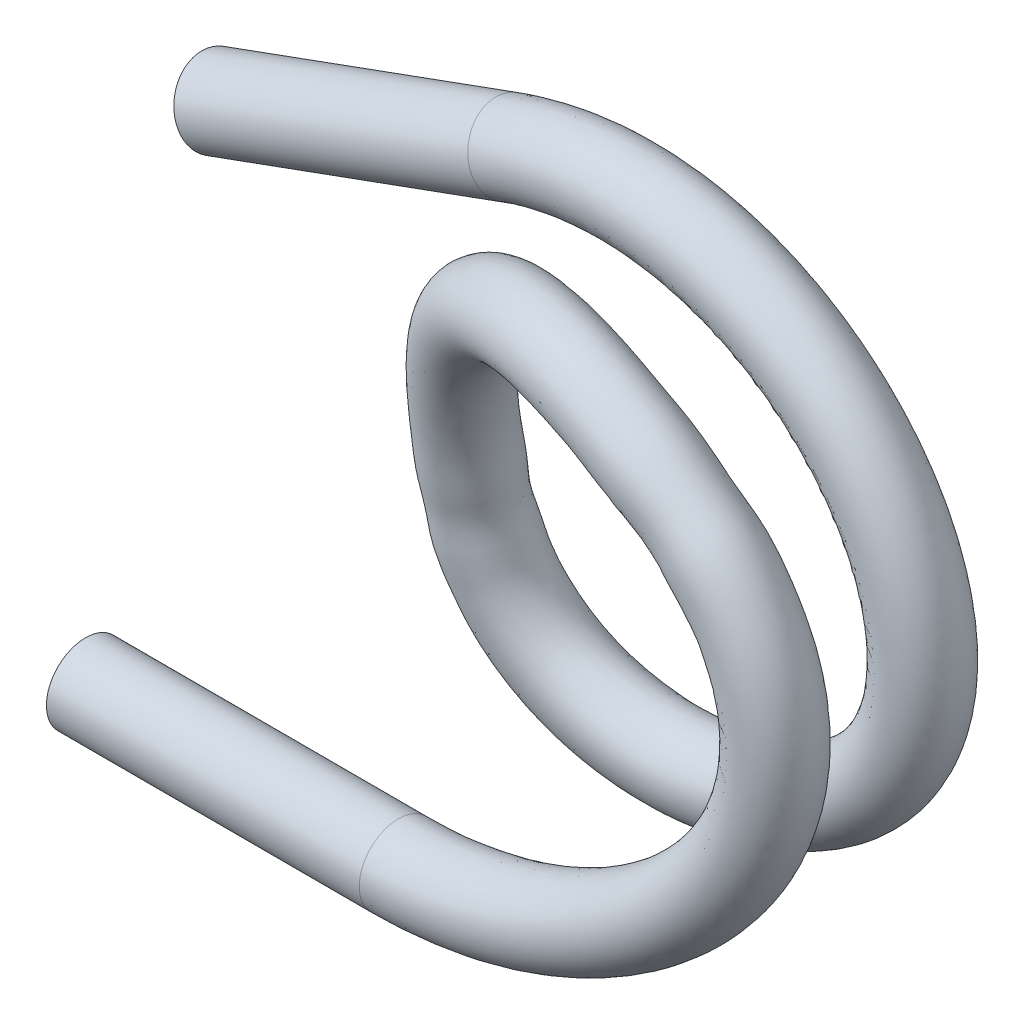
ISO-10303-21;
HEADER;
FILE_DESCRIPTION(('STEP AP214'),'2;1');
FILE_NAME('part.step','',(''),(''),'','','');
FILE_SCHEMA(('AUTOMOTIVE_DESIGN { 1 0 10303 214 1 1 1 1 }'));
ENDSEC;
DATA;
#1=APPLICATION_CONTEXT('core data for automotive mechanical design processes');
#2=APPLICATION_PROTOCOL_DEFINITION('international standard','automotive_design',2000,#1);
#3=PRODUCT_CONTEXT('',#1,'mechanical');
#4=PRODUCT('Part','Part','',(#3));
#5=PRODUCT_RELATED_PRODUCT_CATEGORY('part','',(#4));
#6=PRODUCT_DEFINITION_FORMATION('','',#4);
#7=PRODUCT_DEFINITION_CONTEXT('part definition',#1,'design');
#8=PRODUCT_DEFINITION('design','',#6,#7);
#9=PRODUCT_DEFINITION_SHAPE('','',#8);
#10=(LENGTH_UNIT() NAMED_UNIT(*) SI_UNIT(.MILLI.,.METRE.));
#11=(NAMED_UNIT(*) PLANE_ANGLE_UNIT() SI_UNIT($,.RADIAN.));
#12=(NAMED_UNIT(*) SI_UNIT($,.STERADIAN.) SOLID_ANGLE_UNIT());
#13=UNCERTAINTY_MEASURE_WITH_UNIT(LENGTH_MEASURE(1.E-05),#10,'distance_accuracy_value','');
#14=(GEOMETRIC_REPRESENTATION_CONTEXT(3) GLOBAL_UNCERTAINTY_ASSIGNED_CONTEXT((#13)) GLOBAL_UNIT_ASSIGNED_CONTEXT((#10,
#11,#12)) REPRESENTATION_CONTEXT('',''));
#15=CARTESIAN_POINT('',(0.,0.,0.));
#16=DIRECTION('',(0.,0.,1.));
#17=DIRECTION('',(1.,0.,0.));
#18=AXIS2_PLACEMENT_3D('',#15,#16,#17);
#19=CARTESIAN_POINT('',(10.2502510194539,16.9233195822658,-3.));
#20=DIRECTION('',(-0.939692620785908,-0.34202014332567,0.));
#21=DIRECTION('',(0.34202014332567,-0.939692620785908,0.));
#22=AXIS2_PLACEMENT_3D('',#19,#20,#21);
#23=CYLINDRICAL_SURFACE('',#22,1.5);
#24=CARTESIAN_POINT('',(-1.02606042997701,12.8190778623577,-3.));
#25=DIRECTION('',(0.939692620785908,0.342020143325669,0.));
#26=DIRECTION('',(-0.342020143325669,0.939692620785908,0.));
#27=AXIS2_PLACEMENT_3D('',#24,#25,#26);
#28=CIRCLE('',#27,1.5);
#29=CARTESIAN_POINT('',(-1.53909064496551,14.2286167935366,-3.));
#30=VERTEX_POINT('',#29);
#31=EDGE_CURVE('E50',#30,#30,#28,.T.);
#32=ORIENTED_EDGE('',*,*,#31,.T.);
#33=EDGE_LOOP('',(#32));
#34=FACE_BOUND('',#33,.T.);
#35=CARTESIAN_POINT('',(10.2488920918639,16.9270532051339,-4.4999947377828));
#36=CARTESIAN_POINT('',(10.2434555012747,16.9419901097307,-4.49995272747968));
#37=CARTESIAN_POINT('',(10.2380184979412,16.9569261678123,-4.49965786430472));
#38=CARTESIAN_POINT('',(10.2269771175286,16.9872543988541,-4.49854579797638));
#39=CARTESIAN_POINT('',(10.2213728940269,17.0026460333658,-4.49771234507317));
#40=CARTESIAN_POINT('',(10.2099986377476,17.0338811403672,-4.49547387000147));
#41=CARTESIAN_POINT('',(10.2042289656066,17.0497235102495,-4.49405160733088));
#42=CARTESIAN_POINT('',(10.1925266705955,17.0818522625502,-4.49058370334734));
#43=CARTESIAN_POINT('',(10.1865946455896,17.0981368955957,-4.48851982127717));
#44=CARTESIAN_POINT('',(10.1745719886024,17.1311382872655,-4.48371424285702));
#45=CARTESIAN_POINT('',(10.168482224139,17.1478525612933,-4.48095330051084));
#46=CARTESIAN_POINT('',(10.1561501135,17.1816967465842,-4.47469679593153));
#47=CARTESIAN_POINT('',(10.1499089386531,17.1988233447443,-4.47118099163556));
#48=CARTESIAN_POINT('',(10.137281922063,17.2334705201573,-4.46335586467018));
#49=CARTESIAN_POINT('',(10.1308975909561,17.250986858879,-4.4590253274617));
#50=CARTESIAN_POINT('',(10.1179942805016,17.2863861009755,-4.44951013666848));
#51=CARTESIAN_POINT('',(10.1114771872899,17.3042637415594,-4.44430333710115));
#52=CARTESIAN_POINT('',(10.0983206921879,17.3403518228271,-4.43297382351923));
#53=CARTESIAN_POINT('',(10.0916835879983,17.358555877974,-4.42682809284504));
#54=CARTESIAN_POINT('',(10.0783019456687,17.3952560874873,-4.4135583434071));
#55=CARTESIAN_POINT('',(10.0715601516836,17.4137446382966,-4.40641052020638));
#56=CARTESIAN_POINT('',(10.0579867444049,17.4509656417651,-4.3910743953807));
#57=CARTESIAN_POINT('',(10.0511583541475,17.4696891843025,-4.38286160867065));
#58=CARTESIAN_POINT('',(10.0374322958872,17.5073239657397,-4.36533445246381));
#59=CARTESIAN_POINT('',(10.0305383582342,17.5262249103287,-4.35599505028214));
#60=CARTESIAN_POINT('',(10.0167048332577,17.5641498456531,-4.33615569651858));
#61=CARTESIAN_POINT('',(10.0097695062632,17.5831620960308,-4.32563032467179));
#62=CARTESIAN_POINT('',(9.99588003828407,17.6212362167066,-4.30336340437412));
#63=CARTESIAN_POINT('',(9.98893070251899,17.6402848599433,-4.29159623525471));
#64=CARTESIAN_POINT('',(9.97504333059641,17.6783493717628,-4.26679477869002));
#65=CARTESIAN_POINT('',(9.96811064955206,17.6973505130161,-4.25373488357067));
#66=CARTESIAN_POINT('',(9.95428998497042,17.7352286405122,-4.22630319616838));
#67=CARTESIAN_POINT('',(9.94740789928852,17.7540894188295,-4.21190604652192));
#68=CARTESIAN_POINT('',(9.93372503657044,17.7915866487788,-4.18176282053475));
#69=CARTESIAN_POINT('',(9.92693067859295,17.8102054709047,-4.16599189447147));
#70=CARTESIAN_POINT('',(9.91346293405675,17.8471102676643,-4.13307349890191));
#71=CARTESIAN_POINT('',(9.90679644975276,17.8653772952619,-4.11590195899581));
#72=CARTESIAN_POINT('',(9.89362690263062,17.9014623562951,-4.08016582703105));
#73=CARTESIAN_POINT('',(9.88713116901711,17.9192602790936,-4.06157822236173));
#74=CARTESIAN_POINT('',(9.87434798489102,17.9542843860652,-4.02300623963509));
#75=CARTESIAN_POINT('',(9.86806821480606,17.9714895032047,-4.0030001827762));
#76=CARTESIAN_POINT('',(9.85576373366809,18.005200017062,-3.96160193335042));
#77=CARTESIAN_POINT('',(9.84974695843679,18.0216836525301,-3.94018965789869));
#78=CARTESIAN_POINT('',(9.83801655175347,18.0538196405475,-3.89600546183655));
#79=CARTESIAN_POINT('',(9.83231099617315,18.069449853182,-3.87321529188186));
#80=CARTESIAN_POINT('',(9.82125165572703,18.0997459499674,-3.82631858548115));
#81=CARTESIAN_POINT('',(9.81590595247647,18.1143896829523,-3.80219582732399));
#82=CARTESIAN_POINT('',(9.80561478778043,18.142580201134,-3.75269584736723));
#83=CARTESIAN_POINT('',(9.80067726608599,18.1561052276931,-3.72730459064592));
#84=CARTESIAN_POINT('',(9.79124932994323,18.1819301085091,-3.67534489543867));
#85=CARTESIAN_POINT('',(9.78676654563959,18.1942090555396,-3.64876464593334));
#86=CARTESIAN_POINT('',(9.78043229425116,18.2115591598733,-3.60821874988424));
#87=CARTESIAN_POINT('',(9.77837666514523,18.2171896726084,-3.59452128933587));
#88=CARTESIAN_POINT('',(9.77439463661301,18.2280966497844,-3.566869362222));
#89=CARTESIAN_POINT('',(9.7724690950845,18.2333707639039,-3.55291384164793));
#90=CARTESIAN_POINT('',(9.76875242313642,18.243550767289,-3.52476151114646));
#91=CARTESIAN_POINT('',(9.76696210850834,18.248454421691,-3.51056378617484));
#92=CARTESIAN_POINT('',(9.76352066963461,18.2578804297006,-3.48194307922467));
#93=CARTESIAN_POINT('',(9.7618703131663,18.2624006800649,-3.46751931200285));
#94=CARTESIAN_POINT('',(9.75871330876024,18.2710475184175,-3.43846374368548));
#95=CARTESIAN_POINT('',(9.75720737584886,18.2751721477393,-3.42383128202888));
#96=CARTESIAN_POINT('',(9.75434340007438,18.2830163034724,-3.39437643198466));
#97=CARTESIAN_POINT('',(9.75298601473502,18.2867340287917,-3.37955349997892));
#98=CARTESIAN_POINT('',(9.75042296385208,18.2937538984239,-3.3497367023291));
#99=CARTESIAN_POINT('',(9.74921789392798,18.2970544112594,-3.33474240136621));
#100=CARTESIAN_POINT('',(9.74696292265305,18.3032304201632,-3.30460265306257));
#101=CARTESIAN_POINT('',(9.74591355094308,18.3061044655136,-3.28945686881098));
#102=CARTESIAN_POINT('',(9.74397302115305,18.3114192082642,-3.25903465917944));
#103=CARTESIAN_POINT('',(9.74308232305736,18.3138586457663,-3.24375798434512));
#104=CARTESIAN_POINT('',(9.74146176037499,18.3182970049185,-3.21309512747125));
#105=CARTESIAN_POINT('',(9.74073228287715,18.3202948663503,-3.19770877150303));
#106=CARTESIAN_POINT('',(9.7394363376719,18.3238441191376,-3.1668482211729));
#107=CARTESIAN_POINT('',(9.73887018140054,18.3253946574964,-3.15137391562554));
#108=CARTESIAN_POINT('',(9.73790259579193,18.3280445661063,-3.12035957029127));
#109=CARTESIAN_POINT('',(9.73750139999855,18.3291432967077,-3.1048194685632));
#110=CARTESIAN_POINT('',(9.73686498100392,18.3308861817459,-3.07369596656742));
#111=CARTESIAN_POINT('',(9.73662991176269,18.3315299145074,-3.05811253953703));
#112=CARTESIAN_POINT('',(9.73632651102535,18.332360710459,-3.02692504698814));
#113=CARTESIAN_POINT('',(9.73625825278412,18.332547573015,-3.01132097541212));
#114=CARTESIAN_POINT('',(9.73628875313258,18.3324638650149,-2.98011496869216));
#115=CARTESIAN_POINT('',(9.73638750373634,18.3321933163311,-2.96451303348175));
#116=CARTESIAN_POINT('',(9.73675181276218,18.3311953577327,-2.93333407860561));
#117=CARTESIAN_POINT('',(9.73701728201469,18.3304681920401,-2.91775705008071));
#118=CARTESIAN_POINT('',(9.73771433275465,18.3285589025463,-2.88665058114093));
#119=CARTESIAN_POINT('',(9.73814574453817,18.3273772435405,-2.87112110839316));
#120=CARTESIAN_POINT('',(9.73917350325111,18.3245621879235,-2.84013220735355));
#121=CARTESIAN_POINT('',(9.7397696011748,18.3229294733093,-2.82467270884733));
#122=CARTESIAN_POINT('',(9.74112508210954,18.319216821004,-2.79384588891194));
#123=CARTESIAN_POINT('',(9.74188413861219,18.3171377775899,-2.77847844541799));
#124=CARTESIAN_POINT('',(9.74356342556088,18.3125382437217,-2.74785744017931));
#125=CARTESIAN_POINT('',(9.74448325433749,18.3100188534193,-2.73260369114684));
#126=CARTESIAN_POINT('',(9.74648152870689,18.3045456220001,-2.70223125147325));
#127=CARTESIAN_POINT('',(9.74755950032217,18.3015930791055,-2.68711229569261));
#128=CARTESIAN_POINT('',(9.74987107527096,18.2952617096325,-2.65702999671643));
#129=CARTESIAN_POINT('',(9.75110413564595,18.2918843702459,-2.64206629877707));
#130=CARTESIAN_POINT('',(9.75372249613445,18.2847126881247,-2.61231435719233));
#131=CARTESIAN_POINT('',(9.7551071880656,18.2809200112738,-2.59752565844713));
#132=CARTESIAN_POINT('',(9.75802503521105,18.2729279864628,-2.56814276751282));
#133=CARTESIAN_POINT('',(9.75955752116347,18.268730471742,-2.55354801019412));
#134=CARTESIAN_POINT('',(9.76276682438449,18.2599400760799,-2.52457117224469));
#135=CARTESIAN_POINT('',(9.76444291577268,18.2553491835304,-2.51018840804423));
#136=CARTESIAN_POINT('',(9.76793495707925,18.24578426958,-2.48165284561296));
#137=CARTESIAN_POINT('',(9.7697501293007,18.240812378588,-2.46749923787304));
#138=CARTESIAN_POINT('',(9.77351559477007,18.2304984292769,-2.43943808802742));
#139=CARTESIAN_POINT('',(9.77546506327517,18.2251586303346,-2.4255296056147));
#140=CARTESIAN_POINT('',(9.77949397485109,18.2141229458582,-2.39797449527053));
#141=CARTESIAN_POINT('',(9.78157255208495,18.2084294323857,-2.38432678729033));
#142=CARTESIAN_POINT('',(9.78797364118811,18.1908958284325,-2.34393507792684));
#143=CARTESIAN_POINT('',(9.7924992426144,18.1784993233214,-2.31746173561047));
#144=CARTESIAN_POINT('',(9.8020085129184,18.1524511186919,-2.26572436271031));
#145=CARTESIAN_POINT('',(9.80698451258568,18.1388204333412,-2.24044830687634));
#146=CARTESIAN_POINT('',(9.81734815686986,18.1104308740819,-2.19118549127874));
#147=CARTESIAN_POINT('',(9.82272783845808,18.0956938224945,-2.16718448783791));
#148=CARTESIAN_POINT('',(9.83385057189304,18.0652236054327,-2.12053630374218));
#149=CARTESIAN_POINT('',(9.83958553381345,18.0495126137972,-2.09787270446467));
#150=CARTESIAN_POINT('',(9.85137018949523,18.0172275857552,-2.05394497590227));
#151=CARTESIAN_POINT('',(9.85741181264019,18.0006756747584,-2.03266241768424));
#152=CARTESIAN_POINT('',(9.86976150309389,17.9668409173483,-1.99152533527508));
#153=CARTESIAN_POINT('',(9.87606165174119,17.9495797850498,-1.9716505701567));
#154=CARTESIAN_POINT('',(9.88888125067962,17.9144555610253,-1.93334143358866));
#155=CARTESIAN_POINT('',(9.89539304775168,17.8966134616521,-1.91488524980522));
#156=CARTESIAN_POINT('',(9.90859057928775,17.8604514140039,-1.87941089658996));
#157=CARTESIAN_POINT('',(9.91526901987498,17.8421514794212,-1.86236960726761));
#158=CARTESIAN_POINT('',(9.92875677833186,17.8051915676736,-1.82970948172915));
#159=CARTESIAN_POINT('',(9.93555923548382,17.7865504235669,-1.814066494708));
#160=CARTESIAN_POINT('',(9.94925467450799,17.7490184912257,-1.78417591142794));
#161=CARTESIAN_POINT('',(9.95614128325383,17.7301452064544,-1.76990341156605));
#162=CARTESIAN_POINT('',(9.96996767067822,17.692251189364,-1.74271694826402));
#163=CARTESIAN_POINT('',(9.97690160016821,17.6732465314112,-1.72977759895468));
#164=CARTESIAN_POINT('',(9.99078845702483,17.6351832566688,-1.70521247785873));
#165=CARTESIAN_POINT('',(9.99773607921,17.6161392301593,-1.69356109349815));
#166=CARTESIAN_POINT('',(10.0116194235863,17.5780817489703,-1.67152045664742));
#167=CARTESIAN_POINT('',(10.0185503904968,17.5590813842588,-1.66110559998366));
#168=CARTESIAN_POINT('',(10.0323728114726,17.5211867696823,-1.64148159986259));
#169=CARTESIAN_POINT('',(10.0392600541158,17.5023041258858,-1.6322470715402));
#170=CARTESIAN_POINT('',(10.0529706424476,17.464711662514,-1.61492372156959));
#171=CARTESIAN_POINT('',(10.0597903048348,17.4460120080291,-1.60680991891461));
#172=CARTESIAN_POINT('',(10.0733444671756,17.4088437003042,-1.59166566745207));
#173=CARTESIAN_POINT('',(10.0800757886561,17.3903838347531,-1.58461079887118));
#174=CARTESIAN_POINT('',(10.0934349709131,17.3537451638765,-1.57152080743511));
#175=CARTESIAN_POINT('',(10.1000601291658,17.3355738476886,-1.56546195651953));
#176=CARTESIAN_POINT('',(10.1131914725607,17.2995547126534,-1.55430007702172));
#177=CARTESIAN_POINT('',(10.1196953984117,17.2817131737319,-1.5491741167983));
#178=CARTESIAN_POINT('',(10.1325713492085,17.2463889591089,-1.53981457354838));
#179=CARTESIAN_POINT('',(10.1389415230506,17.2289114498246,-1.53555893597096));
#180=CARTESIAN_POINT('',(10.1515394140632,17.1943441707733,-1.52787772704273));
#181=CARTESIAN_POINT('',(10.1577656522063,17.1772585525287,-1.52443103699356));
#182=CARTESIAN_POINT('',(10.1700672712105,17.143498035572,-1.51830707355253));
#183=CARTESIAN_POINT('',(10.1761415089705,17.1268263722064,-1.51560965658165));
#184=CARTESIAN_POINT('',(10.1881326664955,17.0939114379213,-1.51092566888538));
#185=CARTESIAN_POINT('',(10.1940487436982,17.0776705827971,-1.50891995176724));
#186=CARTESIAN_POINT('',(10.2057188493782,17.0456302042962,-1.50556316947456));
#187=CARTESIAN_POINT('',(10.2114723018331,17.0298323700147,-1.50419396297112));
#188=CARTESIAN_POINT('',(10.2228139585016,16.998686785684,-1.50205665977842));
#189=CARTESIAN_POINT('',(10.2284018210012,16.9833400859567,-1.50127142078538));
#190=CARTESIAN_POINT('',(10.239410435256,16.9531018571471,-1.50025112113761));
#191=CARTESIAN_POINT('',(10.2448310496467,16.9382108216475,-1.49999990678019));
#192=CARTESIAN_POINT('',(10.2502510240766,16.9233195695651,-1.50000000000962));
#193=B_SPLINE_CURVE_WITH_KNOTS('',3,(#35,#36,#37,#38,#39,#40,#41,#42,#43,#44,#45,#46,#47,#48,
#49,#50,#51,#52,#53,#54,#55,#56,#57,#58,#59,#60,#61,#62,#63,#64,#65,#66,#67,#68,#69,#70,#71,#72,
#73,#74,#75,#76,#77,#78,#79,#80,#81,#82,#83,#84,#85,#86,#87,#88,#89,#90,#91,#92,#93,#94,#95,#96,
#97,#98,#99,#100,#101,#102,#103,#104,#105,#106,#107,#108,#109,#110,#111,#112,#113,#114,#115,
#116,#117,#118,#119,#120,#121,#122,#123,#124,#125,#126,#127,#128,#129,#130,#131,#132,#133,#134,
#135,#136,#137,#138,#139,#140,#141,#142,#143,#144,#145,#146,#147,#148,#149,#150,#151,#152,#153,
#154,#155,#156,#157,#158,#159,#160,#161,#162,#163,#164,#165,#166,#167,#168,#169,#170,#171,#172,
#173,#174,#175,#176,#177,#178,#179,#180,#181,#182,#183,#184,#185,#186,#187,#188,#189,#190,#191,
#192),.UNSPECIFIED.,.F.,.F.,(4,2,2,2,2,2,2,2,2,2,2,2,2,2,2,2,2,2,2,2,2,2,2,2,2,2,2,2,2,2,2,2,2,
2,2,2,2,2,2,2,2,2,2,2,2,2,2,2,2,2,2,2,2,2,2,2,2,2,2,2,2,2,2,2,2,2,2,2,2,2,2,2,2,2,2,2,2,2,4),
(0.,0.0476847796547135,0.0968800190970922,0.147630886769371,0.199981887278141,0.253976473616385,
0.309656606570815,0.367062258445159,0.426230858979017,0.487196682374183,0.549990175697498,
0.614637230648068,0.681158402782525,0.74956808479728,0.819873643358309,0.89207453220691,
0.966161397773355,1.04211519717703,1.11990635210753,1.19949396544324,1.28082513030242,
1.36383436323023,1.44844319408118,1.53455994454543,1.6220797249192,1.71088467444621,
1.75573383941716,1.8008545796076,1.84622877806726,1.89183765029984,1.93766178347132,
1.98368117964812,2.02987530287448,2.07622312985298,2.12270320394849,2.16929369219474,
2.21597244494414,2.26271705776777,2.30950493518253,2.35631335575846,2.40311953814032,
2.44990070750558,2.49663416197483,2.5432973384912,2.58986787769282,2.63632368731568,
2.68264300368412,2.72880445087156,2.77478709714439,2.82057050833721,2.86613479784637,
2.91146067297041,2.95652947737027,3.0013232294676,3.09000753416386,3.17739453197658,
3.26336761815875,3.34782319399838,3.43067088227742,3.51183350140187,3.59124682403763,
3.66885915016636,3.74463072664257,3.81853304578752,3.89054805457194,3.96066730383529,
4.02889106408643,4.09522743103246,4.1596914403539,4.22230420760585,4.28309210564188,
4.34208598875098,4.39932046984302,4.45483325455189,4.50866453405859,4.56085643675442,
4.61145253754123,4.66049742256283,4.70803630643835),.UNSPECIFIED.);
#194=CARTESIAN_POINT('',(10.2495741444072,16.9251871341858,-4.49999736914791));
#195=VERTEX_POINT('',#194);
#196=CARTESIAN_POINT('',(10.2509305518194,16.9214525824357,-1.50000263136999));
#197=VERTEX_POINT('',#196);
#198=EDGE_CURVE('E57',#195,#197,#193,.T.);
#199=ORIENTED_EDGE('',*,*,#198,.F.);
#200=CARTESIAN_POINT('',(10.2488920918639,16.9270532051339,-4.4999947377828));
#201=CARTESIAN_POINT('',(9.21902520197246,19.744731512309,-4.49204826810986));
#202=CARTESIAN_POINT('',(9.2217430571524,19.7372642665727,-1.49205879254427));
#203=CARTESIAN_POINT('',(10.2516099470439,16.9195859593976,-1.5000052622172));
#204=CARTESIAN_POINT('',(11.2814768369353,14.1019076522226,-1.50795173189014));
#205=CARTESIAN_POINT('',(11.2787589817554,14.1093748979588,-4.50794120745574));
#206=CARTESIAN_POINT('',(10.2488920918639,16.9270532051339,-4.4999947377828));
#207=(BOUNDED_CURVE() B_SPLINE_CURVE(3,(#200,#201,#202,#203,#204,#205,#206),.UNSPECIFIED.,.T.,
.F.) B_SPLINE_CURVE_WITH_KNOTS((4,3,4),(0.,0.5,1.),
.UNSPECIFIED.) CURVE() GEOMETRIC_REPRESENTATION_ITEM() RATIONAL_B_SPLINE_CURVE((1.,
0.333333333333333,0.333333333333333,1.,0.333333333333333,0.333333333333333,1.)) REPRESENTATION_ITEM(''));
#208=EDGE_CURVE('E12',#197,#195,#207,.T.);
#209=ORIENTED_EDGE('',*,*,#208,.F.);
#210=EDGE_LOOP('',(#199,#209));
#211=FACE_BOUND('',#210,.T.);
#212=ADVANCED_FACE('F40',(#34,#211),#23,.T.);
#213=CARTESIAN_POINT('',(-1.02606042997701,12.8190778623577,-3.));
#214=DIRECTION('',(0.939692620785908,0.342020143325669,0.));
#215=DIRECTION('',(-0.342020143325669,0.939692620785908,0.));
#216=AXIS2_PLACEMENT_3D('',#213,#214,#215);
#217=PLANE('',#216);
#218=ORIENTED_EDGE('',*,*,#31,.F.);
#219=EDGE_LOOP('',(#218));
#220=FACE_BOUND('',#219,.T.);
#221=ADVANCED_FACE('F121',(#220),#217,.F.);
#222=CARTESIAN_POINT('',(12.,-3.0162223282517,3.));
#223=DIRECTION('',(1.,0.,0.));
#224=DIRECTION('',(0.,0.,-1.));
#225=AXIS2_PLACEMENT_3D('',#222,#223,#224);
#226=CIRCLE('',#225,1.5);
#227=DIRECTION('',(-0.999999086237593,0.00135185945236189,0.));
#228=VECTOR('',#227,1.);
#229=SURFACE_OF_LINEAR_EXTRUSION('',#226,#228);
#230=CARTESIAN_POINT('',(12.,-3.0162223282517,1.5));
#231=VERTEX_POINT('',#230);
#232=EDGE_CURVE('E66',#231,#231,#226,.T.);
#233=ORIENTED_EDGE('',*,*,#232,.F.);
#234=EDGE_LOOP('',(#233));
#235=FACE_BOUND('',#234,.T.);
#236=CARTESIAN_POINT('',(0.,-3.,3.));
#237=DIRECTION('',(1.,0.,0.));
#238=DIRECTION('',(0.,0.,-1.));
#239=AXIS2_PLACEMENT_3D('',#236,#237,#238);
#240=CIRCLE('',#239,1.5);
#241=CARTESIAN_POINT('',(0.,-3.,1.5));
#242=VERTEX_POINT('',#241);
#243=EDGE_CURVE('E60',#242,#242,#240,.T.);
#244=ORIENTED_EDGE('',*,*,#243,.T.);
#245=EDGE_LOOP('',(#244));
#246=FACE_BOUND('',#245,.T.);
#247=ADVANCED_FACE('F115',(#235,#246),#229,.F.);
#248=CARTESIAN_POINT('',(0.,-3.,3.));
#249=DIRECTION('',(1.,0.,0.));
#250=DIRECTION('',(0.,0.,-1.));
#251=AXIS2_PLACEMENT_3D('',#248,#249,#250);
#252=PLANE('',#251);
#253=ORIENTED_EDGE('',*,*,#243,.F.);
#254=EDGE_LOOP('',(#253));
#255=FACE_BOUND('',#254,.T.);
#256=ADVANCED_FACE('F83',(#255),#252,.F.);
#257=CARTESIAN_POINT('',(12.,-3.0162223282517,1.5));
#258=CARTESIAN_POINT('',(13.0179529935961,-3.01759845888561,1.5));
#259=CARTESIAN_POINT('',(15.0075744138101,-2.83155836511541,1.50050056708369));
#260=CARTESIAN_POINT('',(17.7860871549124,-2.06084666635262,1.50248290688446));
#261=CARTESIAN_POINT('',(20.2957414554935,-0.87421759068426,1.5054282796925));
#262=CARTESIAN_POINT('',(22.4724856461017,0.652877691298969,1.50906220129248));
#263=CARTESIAN_POINT('',(24.2525982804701,2.44502247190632,1.51313270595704));
#264=CARTESIAN_POINT('',(25.4620994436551,4.2614183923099,1.51695623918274));
#265=CARTESIAN_POINT('',(26.1795728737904,5.99639598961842,1.52048906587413));
#266=CARTESIAN_POINT('',(26.5022258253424,7.5885576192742,1.52301644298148));
#267=CARTESIAN_POINT('',(26.4800133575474,9.18743399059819,1.52703076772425));
#268=CARTESIAN_POINT('',(26.0664699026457,10.7314292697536,1.52398800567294));
#269=CARTESIAN_POINT('',(25.3074156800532,12.2991832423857,1.54524110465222));
#270=CARTESIAN_POINT('',(23.9793383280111,13.3847308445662,1.47707457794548));
#271=CARTESIAN_POINT('',(23.3121053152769,14.7021070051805,1.62756711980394));
#272=CARTESIAN_POINT('',(22.8037031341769,15.2759638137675,1.67384341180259));
#273=CARTESIAN_POINT('',(22.1980973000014,15.9016518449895,1.71461630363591));
#274=CARTESIAN_POINT('',(20.82305938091,16.3404041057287,1.57775827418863));
#275=CARTESIAN_POINT('',(19.2329674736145,16.8827422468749,1.36367429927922));
#276=CARTESIAN_POINT('',(17.7400195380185,17.0167239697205,1.04677825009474));
#277=CARTESIAN_POINT('',(16.3621320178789,16.8739686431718,0.664443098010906));
#278=CARTESIAN_POINT('',(15.100931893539,16.4448731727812,0.227443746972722));
#279=CARTESIAN_POINT('',(13.9787285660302,15.7525195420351,-0.244078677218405));
#280=CARTESIAN_POINT('',(13.0098401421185,14.8114077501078,-0.733094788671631));
#281=CARTESIAN_POINT('',(12.2136823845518,13.6381623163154,-1.22148989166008));
#282=CARTESIAN_POINT('',(11.5917640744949,12.2473704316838,-1.69520758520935));
#283=CARTESIAN_POINT('',(11.2088874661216,10.6554539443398,-2.12795690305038));
#284=CARTESIAN_POINT('',(10.9152747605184,8.98767364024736,-2.51302395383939));
#285=CARTESIAN_POINT('',(11.181668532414,7.6595985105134,-2.68929567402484));
#286=CARTESIAN_POINT('',(10.9312349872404,6.92431766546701,-2.85178138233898));
#287=CARTESIAN_POINT('',(10.7254575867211,6.36717336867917,-2.97593938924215));
#288=CARTESIAN_POINT('',(10.341871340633,5.47905166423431,-3.19667600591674));
#289=CARTESIAN_POINT('',(10.9629951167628,4.26369296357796,-3.32975226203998));
#290=CARTESIAN_POINT('',(11.4947139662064,3.09526013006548,-3.53345830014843));
#291=CARTESIAN_POINT('',(12.343358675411,2.10432506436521,-3.703908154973));
#292=CARTESIAN_POINT('',(13.3678398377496,1.3055806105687,-3.86504686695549));
#293=CARTESIAN_POINT('',(14.5857445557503,0.719140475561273,-4.00827929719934));
#294=CARTESIAN_POINT('',(16.1307529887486,0.30338149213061,-4.15182472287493));
#295=CARTESIAN_POINT('',(18.0102122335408,0.197378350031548,-4.28312718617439));
#296=CARTESIAN_POINT('',(20.1394221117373,0.549299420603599,-4.39022940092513));
#297=CARTESIAN_POINT('',(22.1382335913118,1.3515842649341,-4.45985491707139));
#298=CARTESIAN_POINT('',(23.6850743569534,2.43252582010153,-4.49203313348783));
#299=CARTESIAN_POINT('',(24.4673462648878,3.33860873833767,-4.49829476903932));
#300=CARTESIAN_POINT('',(24.7712743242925,3.74111754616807,-4.49890222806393));
#301=CARTESIAN_POINT('',(25.0458998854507,4.10993061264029,-4.49928829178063));
#302=CARTESIAN_POINT('',(25.5173697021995,4.81580865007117,-4.50035546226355));
#303=CARTESIAN_POINT('',(25.9597687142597,6.13904116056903,-4.49985614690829));
#304=CARTESIAN_POINT('',(26.1696422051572,7.65436800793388,-4.50003626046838));
#305=CARTESIAN_POINT('',(26.0089303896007,9.32317188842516,-4.49998361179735));
#306=CARTESIAN_POINT('',(25.5037389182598,10.9546347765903,-4.49999771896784));
#307=CARTESIAN_POINT('',(24.6800471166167,12.5087414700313,-4.49999393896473));
#308=CARTESIAN_POINT('',(23.5689562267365,13.9420085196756,-4.49999495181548));
#309=CARTESIAN_POINT('',(22.2001719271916,15.2118854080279,-4.49999468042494));
#310=CARTESIAN_POINT('',(20.6037611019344,16.2755641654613,-4.49999475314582));
#311=CARTESIAN_POINT('',(18.8096848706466,17.0902921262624,-4.49999473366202));
#312=CARTESIAN_POINT('',(16.8479544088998,17.6132964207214,-4.49999473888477));
#313=CARTESIAN_POINT('',(14.7485173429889,17.8017800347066,-4.49999473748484));
#314=CARTESIAN_POINT('',(12.5415920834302,17.6130417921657,-4.49999473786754));
#315=CARTESIAN_POINT('',(11.0181687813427,17.207047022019,-4.4999947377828));
#316=CARTESIAN_POINT('',(10.2488920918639,16.9270532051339,-4.4999947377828));
#317=CARTESIAN_POINT('',(12.,-0.0162223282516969,1.5));
#318=CARTESIAN_POINT('',(13.0172314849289,-0.0175974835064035,1.5));
#319=CARTESIAN_POINT('',(14.3730232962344,0.133873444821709,1.49995445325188));
#320=CARTESIAN_POINT('',(16.7564977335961,0.764012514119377,1.50114770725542));
#321=CARTESIAN_POINT('',(18.7762142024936,1.7326795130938,1.50293290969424));
#322=CARTESIAN_POINT('',(20.5372709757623,2.96402522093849,1.50523365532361));
#323=CARTESIAN_POINT('',(21.9244339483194,4.36687762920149,1.50765247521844));
#324=CARTESIAN_POINT('',(22.8127487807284,5.70998626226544,1.51020843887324));
#325=CARTESIAN_POINT('',(23.2967482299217,6.89088489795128,1.51127351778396));
#326=CARTESIAN_POINT('',(23.4920542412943,7.87764863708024,1.51550456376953));
#327=CARTESIAN_POINT('',(23.4794008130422,8.78648631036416,1.50622404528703));
#328=CARTESIAN_POINT('',(23.2450971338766,9.60810985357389,1.54615675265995));
#329=CARTESIAN_POINT('',(22.8551908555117,10.5735458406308,1.40135894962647));
#330=CARTESIAN_POINT('',(21.8743880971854,11.0778787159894,1.91605362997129));
#331=CARTESIAN_POINT('',(21.6415454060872,12.4414369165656,0.798675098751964));
#332=CARTESIAN_POINT('',(21.3345441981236,12.9934674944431,0.44715747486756));
#333=CARTESIAN_POINT('',(20.9548830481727,13.5834867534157,0.0908101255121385));
#334=CARTESIAN_POINT('',(19.8343205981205,13.7448370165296,0.452458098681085));
#335=CARTESIAN_POINT('',(18.7988008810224,14.112844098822,0.229690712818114));
#336=CARTESIAN_POINT('',(17.8766665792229,14.138761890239,0.13751959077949));
#337=CARTESIAN_POINT('',(17.1040993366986,14.0221661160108,-0.0153660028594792));
#338=CARTESIAN_POINT('',(16.4189810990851,13.7529571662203,-0.171391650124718));
#339=CARTESIAN_POINT('',(15.7962842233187,13.3406297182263,-0.347956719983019));
#340=CARTESIAN_POINT('',(15.2209196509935,12.7641293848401,-0.547499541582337));
#341=CARTESIAN_POINT('',(14.7053173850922,12.0006968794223,-0.762225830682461));
#342=CARTESIAN_POINT('',(14.265517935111,11.0403545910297,-1.01318996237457));
#343=CARTESIAN_POINT('',(13.9638011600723,9.85678193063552,-1.1803284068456));
#344=CARTESIAN_POINT('',(13.7320853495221,8.61532882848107,-1.61846886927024));
#345=CARTESIAN_POINT('',(13.8837081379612,7.43566494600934,-1.18807188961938));
#346=CARTESIAN_POINT('',(13.7274844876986,6.96577894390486,-1.89520464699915));
#347=CARTESIAN_POINT('',(13.5989843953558,6.62473837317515,-2.48031920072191));
#348=CARTESIAN_POINT('',(13.3662112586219,6.15360131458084,-3.64313348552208));
#349=CARTESIAN_POINT('',(13.7436492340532,5.36897337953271,-3.17904385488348));
#350=CARTESIAN_POINT('',(14.0133189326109,4.77788532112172,-3.46810796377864));
#351=CARTESIAN_POINT('',(14.429097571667,4.28447136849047,-3.52305004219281));
#352=CARTESIAN_POINT('',(14.9394887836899,3.87812169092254,-3.64019607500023));
#353=CARTESIAN_POINT('',(15.6091396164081,3.54579782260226,-3.74412466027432));
#354=CARTESIAN_POINT('',(16.5481620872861,3.28405355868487,-3.87299110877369));
#355=CARTESIAN_POINT('',(17.8011615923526,3.20249047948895,-4.0156280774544));
#356=CARTESIAN_POINT('',(19.2914609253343,3.44247253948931,-4.16213180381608));
#357=CARTESIAN_POINT('',(20.6726457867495,3.99164168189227,-4.27008187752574));
#358=CARTESIAN_POINT('',(21.6800051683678,4.69835976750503,-4.36015637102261));
#359=CARTESIAN_POINT('',(22.1202776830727,5.21124944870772,-4.34819101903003));
#360=CARTESIAN_POINT('',(22.3050561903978,5.44586585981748,-4.38702007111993));
#361=CARTESIAN_POINT('',(22.4730009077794,5.66136331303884,-4.42518468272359));
#362=CARTESIAN_POINT('',(22.7763463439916,6.07142714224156,-4.55019823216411));
#363=CARTESIAN_POINT('',(23.0167814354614,6.83073139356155,-4.49170599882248));
#364=CARTESIAN_POINT('',(23.1439213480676,7.69630434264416,-4.5128053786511));
#365=CARTESIAN_POINT('',(23.0499708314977,8.71222977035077,-4.50663785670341));
#366=CARTESIAN_POINT('',(22.7241144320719,9.78066367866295,-4.50829043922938));
#367=CARTESIAN_POINT('',(22.1551165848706,10.8615448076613,-4.507847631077));
#368=CARTESIAN_POINT('',(21.3532607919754,11.8997964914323,-4.50796628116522));
#369=CARTESIAN_POINT('',(20.3405235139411,12.8416607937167,-4.50793448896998));
#370=CARTESIAN_POINT('',(19.145346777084,13.6386764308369,-4.50794300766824));
#371=CARTESIAN_POINT('',(17.8011833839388,14.2512825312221,-4.50794072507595));
#372=CARTESIAN_POINT('',(16.323814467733,14.6415907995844,-4.50794133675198));
#373=CARTESIAN_POINT('',(14.771338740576,14.7935340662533,-4.50794117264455));
#374=CARTESIAN_POINT('',(12.999982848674,14.6178125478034,-4.50794121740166));
#375=CARTESIAN_POINT('',(12.0473893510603,14.3891334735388,-4.50794120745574));
#376=CARTESIAN_POINT('',(11.2787589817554,14.1093748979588,-4.50794120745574));
#377=CARTESIAN_POINT('',(12.,-0.0162223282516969,4.5));
#378=CARTESIAN_POINT('',(13.0172314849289,-0.0175974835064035,4.5));
#379=CARTESIAN_POINT('',(14.3713191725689,0.134235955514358,4.4999541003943));
#380=CARTESIAN_POINT('',(16.7536188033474,0.764420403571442,4.50114669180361));
#381=CARTESIAN_POINT('',(18.7717822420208,1.73306582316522,4.50292851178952));
#382=CARTESIAN_POINT('',(20.5313734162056,2.96418840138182,4.50523262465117));
#383=CARTESIAN_POINT('',(21.9169634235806,4.36641261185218,4.50762599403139));
#384=CARTESIAN_POINT('',(22.8041163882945,5.70885456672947,4.51025359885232));
#385=CARTESIAN_POINT('',(23.2865681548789,6.88770293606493,4.51109893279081));
#386=CARTESIAN_POINT('',(23.4829170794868,7.8755754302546,4.51607695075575));
#387=CARTESIAN_POINT('',(23.4634798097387,8.77269124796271,4.50398231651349));
#388=CARTESIAN_POINT('',(23.2536495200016,9.62923528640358,4.55440028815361));
#389=CARTESIAN_POINT('',(22.7739862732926,10.455235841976,4.37045363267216));
#390=CARTESIAN_POINT('',(22.113812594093,11.4445121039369,5.02345750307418));
#391=CARTESIAN_POINT('',(21.1869963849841,11.7506802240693,3.60552904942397));
#392=CARTESIAN_POINT('',(20.6603114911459,11.969082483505,3.16145884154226));
#393=CARTESIAN_POINT('',(20.0605934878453,12.2253227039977,2.7133824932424));
#394=CARTESIAN_POINT('',(19.2017097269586,12.7914505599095,3.20334225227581));
#395=CARTESIAN_POINT('',(18.103773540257,13.1007429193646,2.97315670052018));
#396=CARTESIAN_POINT('',(17.2081847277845,13.2277988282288,2.91564265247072));
#397=CARTESIAN_POINT('',(16.4204954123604,13.1780518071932,2.78178427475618));
#398=CARTESIAN_POINT('',(15.7102409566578,12.9886665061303,2.64207046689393));
#399=CARTESIAN_POINT('',(15.0426822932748,12.6510317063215,2.47328389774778));
#400=CARTESIAN_POINT('',(14.4090015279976,12.143151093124,2.27339175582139));
#401=CARTESIAN_POINT('',(13.8177045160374,11.4370744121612,2.04842322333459));
#402=CARTESIAN_POINT('',(13.3167215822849,10.5217077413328,1.78367541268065));
#403=CARTESIAN_POINT('',(12.8736354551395,9.3659448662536,1.58109421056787));
#404=CARTESIAN_POINT('',(12.7864485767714,8.14916422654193,1.16063504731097));
#405=CARTESIAN_POINT('',(12.3684679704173,6.95336582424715,1.46771588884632));
#406=CARTESIAN_POINT('',(12.7885247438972,6.50826174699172,0.869538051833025));
#407=CARTESIAN_POINT('',(13.1461330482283,6.18779367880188,0.377073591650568));
#408=CARTESIAN_POINT('',(13.9021422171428,5.75753762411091,-0.595119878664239));
#409=CARTESIAN_POINT('',(13.7541944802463,4.95583796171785,-0.234863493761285));
#410=CARTESIAN_POINT('',(14.1974276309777,4.37925916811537,-0.49206181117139));
#411=CARTESIAN_POINT('',(14.5812670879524,3.89640331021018,-0.554609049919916));
#412=CARTESIAN_POINT('',(15.1169168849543,3.50862039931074,-0.667583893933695));
#413=CARTESIAN_POINT('',(15.7937107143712,3.20158461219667,-0.769795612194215));
#414=CARTESIAN_POINT('',(16.7424336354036,2.97803559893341,-0.89477788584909));
#415=CARTESIAN_POINT('',(17.9968646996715,2.95086932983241,-1.03235569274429));
#416=CARTESIAN_POINT('',(19.4721920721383,3.25957131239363,-1.17299034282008));
#417=CARTESIAN_POINT('',(20.8312581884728,3.86526744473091,-1.27647813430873));
#418=CARTESIAN_POINT('',(21.7907698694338,4.62191858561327,-1.36361768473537));
#419=CARTESIAN_POINT('',(22.2446780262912,5.12676905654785,-1.35119234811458));
#420=CARTESIAN_POINT('',(22.3975012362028,5.38291283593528,-1.38921561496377));
#421=CARTESIAN_POINT('',(22.5339061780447,5.61962133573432,-1.42660809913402));
#422=CARTESIAN_POINT('',(22.7345138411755,6.09818019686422,-1.54948730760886));
#423=CARTESIAN_POINT('',(23.0222727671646,6.82357713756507,-1.49199370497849));
#424=CARTESIAN_POINT('',(23.1319267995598,7.699121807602,-1.51273285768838));
#425=CARTESIAN_POINT('',(23.0431973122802,8.70989981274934,-1.50667063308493));
#426=CARTESIAN_POINT('',(22.7164617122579,9.77775751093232,-1.50829500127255));
#427=CARTESIAN_POINT('',(22.1484991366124,10.8571388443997,-1.50785975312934));
#428=CARTESIAN_POINT('',(21.3473639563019,11.8944088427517,-1.5079763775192));
#429=CARTESIAN_POINT('',(20.3355946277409,12.8353854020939,-1.50794512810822));
#430=CARTESIAN_POINT('',(19.1414727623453,13.6316979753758,-1.5079535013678));
#431=CARTESIAN_POINT('',(17.7985022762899,14.2437658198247,-1.50795125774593));
#432=CARTESIAN_POINT('',(16.3224153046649,14.633721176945,-1.50795185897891));
#433=CARTESIAN_POINT('',(14.7713886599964,14.785565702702,-1.50795169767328));
#434=CARTESIAN_POINT('',(13.0011855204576,14.6098767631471,-1.50795174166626));
#435=CARTESIAN_POINT('',(12.0501072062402,14.3816662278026,-1.50795173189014));
#436=CARTESIAN_POINT('',(11.2814768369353,14.1019076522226,-1.50795173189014));
#437=CARTESIAN_POINT('',(12.,-3.0162223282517,4.5));
#438=CARTESIAN_POINT('',(13.0175922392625,-3.017597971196,4.5));
#439=CARTESIAN_POINT('',(15.0060377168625,-2.83119608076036,4.50050021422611));
#440=CARTESIAN_POINT('',(17.7831633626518,-2.06043871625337,4.50248189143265));
#441=CARTESIAN_POINT('',(20.2913215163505,-0.873831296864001,4.50542388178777));
#442=CARTESIAN_POINT('',(22.4665848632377,0.653040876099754,4.50906117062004));
#443=CARTESIAN_POINT('',(24.2451286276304,2.44455745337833,4.51310622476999));
#444=CARTESIAN_POINT('',(25.4534668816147,4.26028669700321,4.51700139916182));
#445=CARTESIAN_POINT('',(26.1693928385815,5.99321402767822,4.52031448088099));
#446=CARTESIAN_POINT('',(26.4930886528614,7.58648441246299,4.52358882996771));
#447=CARTESIAN_POINT('',(26.4640923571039,9.17363892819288,4.5247890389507));
#448=CARTESIAN_POINT('',(26.0750222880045,10.7525547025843,4.5322315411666));
#449=CARTESIAN_POINT('',(25.2262110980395,12.1808732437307,4.5143357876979));
#450=CARTESIAN_POINT('',(24.2187628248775,13.7513642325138,4.58447845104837));
#451=CARTESIAN_POINT('',(22.8575562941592,14.0113503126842,4.43442107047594));
#452=CARTESIAN_POINT('',(22.1294704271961,14.2515788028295,4.38814477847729));
#453=CARTESIAN_POINT('',(21.3038077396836,14.5434877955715,4.33718867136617));
#454=CARTESIAN_POINT('',(20.1904485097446,15.3870176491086,4.32864242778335));
#455=CARTESIAN_POINT('',(18.53794013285,15.8706410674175,4.10714028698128));
#456=CARTESIAN_POINT('',(17.0715376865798,16.1057609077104,3.82490131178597));
#457=CARTESIAN_POINT('',(15.6785280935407,16.0298543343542,3.46159337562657));
#458=CARTESIAN_POINT('',(14.3921917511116,15.6805825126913,3.04090586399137));
#459=CARTESIAN_POINT('',(13.2251266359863,15.0629215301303,2.57716194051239));
#460=CARTESIAN_POINT('',(12.1979220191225,14.1904294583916,2.0877965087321));
#461=CARTESIAN_POINT('',(11.326069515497,13.0745398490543,1.58915916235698));
#462=CARTESIAN_POINT('',(10.6429677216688,11.7287235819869,1.10165778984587));
#463=CARTESIAN_POINT('',(10.1187217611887,10.1646168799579,0.633465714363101));
#464=CARTESIAN_POINT('',(9.96963798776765,8.52150903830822,0.26607996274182));
#465=CARTESIAN_POINT('',(9.66642836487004,7.17729938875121,-0.0335078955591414));
#466=CARTESIAN_POINT('',(9.99227524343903,6.46680046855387,-0.0870386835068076));
#467=CARTESIAN_POINT('',(10.2726062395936,5.9302286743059,-0.118546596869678));
#468=CARTESIAN_POINT('',(10.8778022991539,5.08298797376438,-0.148662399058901));
#469=CARTESIAN_POINT('',(10.9735403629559,3.85055754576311,-0.38557190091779));
#470=CARTESIAN_POINT('',(11.6788226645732,2.69663397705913,-0.557412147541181));
#471=CARTESIAN_POINT('',(12.4955281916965,1.71625700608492,-0.735467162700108));
#472=CARTESIAN_POINT('',(13.5452679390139,0.9360793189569,-0.892434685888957));
#473=CARTESIAN_POINT('',(14.7703156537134,0.374927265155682,-1.03395024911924));
#474=CARTESIAN_POINT('',(16.3250245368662,-0.00263646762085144,-1.17361149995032));
#475=CARTESIAN_POINT('',(18.2059153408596,-0.0542427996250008,-1.29985480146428));
#476=CARTESIAN_POINT('',(20.3201532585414,0.366398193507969,-1.40108793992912));
#477=CARTESIAN_POINT('',(22.2968459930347,1.22521002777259,-1.46625117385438));
#478=CARTESIAN_POINT('',(23.7958390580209,2.3560846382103,-1.49549444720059));
#479=CARTESIAN_POINT('',(24.591746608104,3.254128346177,-1.50129609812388));
#480=CARTESIAN_POINT('',(24.8637193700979,3.67816452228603,-1.50109777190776));
#481=CARTESIAN_POINT('',(25.106805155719,4.06818863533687,-1.50071170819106));
#482=CARTESIAN_POINT('',(25.4755371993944,4.84256170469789,-1.4996445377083));
#483=CARTESIAN_POINT('',(25.9652600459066,6.13188690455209,-1.50014385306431));
#484=CARTESIAN_POINT('',(26.1576476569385,7.65718547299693,-1.49996373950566));
#485=CARTESIAN_POINT('',(26.0021568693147,9.32084193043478,-1.50001638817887));
#486=CARTESIAN_POINT('',(25.4960862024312,10.9517286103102,-1.500002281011));
#487=CARTESIAN_POINT('',(24.6734296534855,12.5043355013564,-1.50000606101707));
#488=CARTESIAN_POINT('',(23.5630594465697,13.9366208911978,-1.50000504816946));
#489=CARTESIAN_POINT('',(22.1952428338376,15.2056099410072,-1.50000531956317));
#490=CARTESIAN_POINT('',(20.5998878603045,16.2685859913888,-1.50000524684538));
#491=CARTESIAN_POINT('',(18.8070008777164,17.0827743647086,-1.50000526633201));
#492=CARTESIAN_POINT('',(16.846566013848,17.6054307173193,-1.50000526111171));
#493=CARTESIAN_POINT('',(14.7485270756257,17.7937970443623,-1.50000526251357));
#494=CARTESIAN_POINT('',(12.5429447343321,17.6051605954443,-1.50000526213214));
#495=CARTESIAN_POINT('',(11.0205634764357,17.1994621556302,-1.5000052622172));
#496=CARTESIAN_POINT('',(10.2516099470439,16.9195859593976,-1.5000052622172));
#497=CARTESIAN_POINT('',(12.,-6.0162223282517,4.5));
#498=CARTESIAN_POINT('',(13.0179529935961,-6.01759845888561,4.5));
#499=CARTESIAN_POINT('',(15.640756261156,-5.79662811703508,4.50104632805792));
#500=CARTESIAN_POINT('',(18.8127079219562,-4.88529783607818,4.50381709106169));
#501=CARTESIAN_POINT('',(21.8108607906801,-3.48072841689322,4.50791925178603));
#502=CARTESIAN_POINT('',(24.4017963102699,-1.65810664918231,4.5128897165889));
#503=CARTESIAN_POINT('',(26.5732938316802,0.522702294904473,4.51858645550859));
#504=CARTESIAN_POINT('',(28.1028173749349,2.81171882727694,4.52374919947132));
#505=CARTESIAN_POINT('',(29.0522175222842,5.09872511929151,4.52953002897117));
#506=CARTESIAN_POINT('',(29.503260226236,7.29739339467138,4.53110070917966));
#507=CARTESIAN_POINT('',(29.4647049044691,9.57458660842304,4.54559576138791));
#508=CARTESIAN_POINT('',(28.8963950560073,11.875874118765,4.5100627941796));
#509=CARTESIAN_POINT('',(27.6784359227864,13.9065106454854,4.65821794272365));
#510=CARTESIAN_POINT('',(26.323713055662,16.0582163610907,4.14549939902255));
#511=CARTESIAN_POINT('',(24.5281162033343,16.2720204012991,5.26331309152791));
#512=CARTESIAN_POINT('',(23.5986293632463,16.5340751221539,5.61483071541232));
#513=CARTESIAN_POINT('',(22.5470219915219,16.8616528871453,5.96099484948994));
#514=CARTESIAN_POINT('',(21.1791872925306,17.9825847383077,5.4539426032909));
#515=CARTESIAN_POINT('',(18.9721067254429,18.6405392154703,5.24112387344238));
#516=CARTESIAN_POINT('',(16.9348906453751,18.983722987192,4.73415997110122));
#517=CARTESIAN_POINT('',(14.9365607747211,18.8816568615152,4.14140247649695));
#518=CARTESIAN_POINT('',(13.0741425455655,18.3724985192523,3.43974126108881));
#519=CARTESIAN_POINT('',(11.4075709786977,17.474811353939,2.68103998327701));
#520=CARTESIAN_POINT('',(9.98684251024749,16.2377078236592,1.9022012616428));
#521=CARTESIAN_POINT('',(8.83443451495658,14.7120052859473,1.12989510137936));
#522=CARTESIAN_POINT('',(7.96921386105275,12.9357394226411,0.419640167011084));
#523=CARTESIAN_POINT('',(7.363808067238,10.9632888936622,-0.314162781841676));
#524=CARTESIAN_POINT('',(7.15282739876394,8.89385385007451,-0.628475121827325));
#525=CARTESIAN_POINT('',(6.96438875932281,7.40123295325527,-1.5347316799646));
#526=CARTESIAN_POINT('',(7.19602574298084,6.42533919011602,-1.04361541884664));
#527=CARTESIAN_POINT('',(7.39907943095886,5.67266366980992,-0.614166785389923));
#528=CARTESIAN_POINT('',(7.85346238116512,4.40843832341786,0.297795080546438));
#529=CARTESIAN_POINT('',(8.19288624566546,2.74527712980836,-0.536280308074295));
#530=CARTESIAN_POINT('',(9.16021769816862,1.01400878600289,-0.622762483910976));
#531=CARTESIAN_POINT('',(10.4097892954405,-0.463889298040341,-0.916325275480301));
#532=CARTESIAN_POINT('',(11.9736189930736,-1.63646176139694,-1.11728547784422));
#533=CARTESIAN_POINT('',(13.7469205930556,-2.45173008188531,-1.29810488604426));
#534=CARTESIAN_POINT('',(15.9076154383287,-2.98330853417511,-1.45244511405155));
#535=CARTESIAN_POINT('',(18.4149659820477,-3.05935492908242,-1.56735391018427));
#536=CARTESIAN_POINT('',(21.1681144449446,-2.52677492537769,-1.62918553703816));
#537=CARTESIAN_POINT('',(23.7624337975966,-1.41484738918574,-1.65602421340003));
#538=CARTESIAN_POINT('',(25.8009082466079,0.0902506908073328,-1.62737120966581));
#539=CARTESIAN_POINT('',(26.9388151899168,1.38148763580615,-1.65139984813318));
#540=CARTESIAN_POINT('',(27.329937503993,1.97341620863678,-1.61297992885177));
#541=CARTESIAN_POINT('',(27.6797041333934,2.51675593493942,-1.57481531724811));
#542=CARTESIAN_POINT('',(28.2165605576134,3.58694321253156,-1.44980176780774));
#543=CARTESIAN_POINT('',(28.9082473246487,5.44019667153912,-1.50829400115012));
#544=CARTESIAN_POINT('',(29.1833685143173,7.61524913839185,-1.48719462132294));
#545=CARTESIAN_POINT('',(28.9611164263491,9.93178404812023,-1.4933621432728));
#546=CARTESIAN_POINT('',(28.2757106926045,12.1256997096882,-1.49170956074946));
#547=CARTESIAN_POINT('',(27.1983601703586,14.1515321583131,-1.4921523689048));
#548=CARTESIAN_POINT('',(25.7787549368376,15.9788329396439,-1.49203371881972));
#549=CARTESIAN_POINT('',(24.0548910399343,17.5758344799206,-1.49206551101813));
#550=CARTESIAN_POINT('',(22.0583029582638,18.9054740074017,-1.49205699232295));
#551=CARTESIAN_POINT('',(19.815499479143,19.9217829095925,-1.49205927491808));
#552=CARTESIAN_POINT('',(17.3707167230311,20.5771402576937,-1.4920586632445));
#553=CARTESIAN_POINT('',(14.7256654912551,20.8020283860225,-1.49205882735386));
#554=CARTESIAN_POINT('',(12.0847039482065,20.6004444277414,-1.49205878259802));
#555=CARTESIAN_POINT('',(9.99101974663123,20.0172580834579,-1.49205879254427));
#556=CARTESIAN_POINT('',(9.2217430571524,19.7372642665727,-1.49205879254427));
#557=CARTESIAN_POINT('',(12.,-6.0162223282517,1.5));
#558=CARTESIAN_POINT('',(13.0186745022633,-6.01759943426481,1.5));
#559=CARTESIAN_POINT('',(15.6421255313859,-5.79699017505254,1.5010466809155));
#560=CARTESIAN_POINT('',(18.8156765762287,-4.88570584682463,1.5038181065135));
#561=CARTESIAN_POINT('',(21.8152687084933,-3.48111469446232,1.50792364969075));
#562=CARTESIAN_POINT('',(24.407700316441,-1.65826983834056,1.51289074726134));
#563=CARTESIAN_POINT('',(26.5807626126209,0.523167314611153,1.51861293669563));
#564=CARTESIAN_POINT('',(28.1114501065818,2.81285052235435,1.52370403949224));
#565=CARTESIAN_POINT('',(29.062397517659,5.10190708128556,1.52970461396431));
#566=CARTESIAN_POINT('',(29.5123974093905,7.29946660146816,1.53052832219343));
#567=CARTESIAN_POINT('',(29.4806259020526,9.58838167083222,1.54783749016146));
#568=CARTESIAN_POINT('',(28.8878426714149,11.8547486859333,1.50181925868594));
#569=CARTESIAN_POINT('',(27.7596405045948,14.0248206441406,1.68912325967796));
#570=CARTESIAN_POINT('',(26.0842885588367,15.691582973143,1.03809552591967));
#571=CARTESIAN_POINT('',(24.9826652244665,16.9627770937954,2.45645914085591));
#572=CARTESIAN_POINT('',(24.2728620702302,17.558460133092,2.90052934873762));
#573=CARTESIAN_POINT('',(23.4413115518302,18.2198169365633,3.33842248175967));
#574=CARTESIAN_POINT('',(21.8117981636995,18.9359711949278,2.70305844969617));
#575=CARTESIAN_POINT('',(19.6671340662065,19.6526403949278,2.49765788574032));
#576=CARTESIAN_POINT('',(17.603372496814,19.8946860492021,1.95603690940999));
#577=CARTESIAN_POINT('',(15.6201646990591,19.7257711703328,1.34425219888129));
#578=CARTESIAN_POINT('',(13.7828826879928,19.1367891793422,0.626279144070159));
#579=CARTESIAN_POINT('',(12.1611729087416,18.1644093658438,-0.14020063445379));
#580=CARTESIAN_POINT('',(10.7987606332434,16.8586861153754,-0.918690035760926));
#581=CARTESIAN_POINT('',(9.72204738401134,15.2756277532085,-1.68075395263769));
#582=CARTESIAN_POINT('',(8.91801021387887,13.454386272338,-2.37722520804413));
#583=CARTESIAN_POINT('',(8.45397377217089,11.4541259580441,-3.07558539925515));
#584=CARTESIAN_POINT('',(8.09846417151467,9.36001845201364,-3.40757903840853));
#585=CARTESIAN_POINT('',(8.47962892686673,7.88353207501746,-4.1905194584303));
#586=CARTESIAN_POINT('',(8.13498548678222,6.88285638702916,-3.80835811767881));
#587=CARTESIAN_POINT('',(7.85193077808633,6.10960836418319,-3.4715595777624));
#588=CARTESIAN_POINT('',(7.31753142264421,4.80450201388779,-2.7502185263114));
#589=CARTESIAN_POINT('',(8.18234099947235,3.15841254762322,-3.48046066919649));
#590=CARTESIAN_POINT('',(8.97610899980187,1.41263493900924,-3.59880863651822));
#591=CARTESIAN_POINT('',(10.2576197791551,-0.075821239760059,-3.88476626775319));
#592=CARTESIAN_POINT('',(11.7961908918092,-1.26696046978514,-4.08989765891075));
#593=CARTESIAN_POINT('',(13.5623494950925,-2.10751687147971,-4.27243393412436));
#594=CARTESIAN_POINT('',(15.7133438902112,-2.67729057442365,-4.43065833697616));
#595=CARTESIAN_POINT('',(18.2192628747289,-2.80773377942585,-4.55062629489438));
#596=CARTESIAN_POINT('',(20.9873832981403,-2.34387369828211,-4.61832699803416));
#597=CARTESIAN_POINT('',(23.6038213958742,-1.28847315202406,-4.64962795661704));
#598=CARTESIAN_POINT('',(25.690143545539,0.166691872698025,-4.62390989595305));
#599=CARTESIAN_POINT('',(26.8144148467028,1.46596802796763,-4.64839851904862));
#600=CARTESIAN_POINT('',(27.2374924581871,2.03636923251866,-4.61078438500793));
#601=CARTESIAN_POINT('',(27.618798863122,2.55849791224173,-4.57339190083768));
#602=CARTESIAN_POINT('',(28.2583930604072,3.56019015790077,-4.45051269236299));
#603=CARTESIAN_POINT('',(28.902755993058,5.44735092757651,-4.50800629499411));
#604=CARTESIAN_POINT('',(29.1953630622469,7.6124316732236,-4.48726714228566));
#605=CARTESIAN_POINT('',(28.9678899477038,9.93411400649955,-4.49332936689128));
#606=CARTESIAN_POINT('',(28.2833634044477,12.1286058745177,-4.4917049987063));
#607=CARTESIAN_POINT('',(27.2049776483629,14.1559381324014,-4.49214024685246));
#608=CARTESIAN_POINT('',(25.7846516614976,15.9842205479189,-4.49202362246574));
#609=CARTESIAN_POINT('',(24.0598203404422,17.5821100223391,-4.49205487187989));
#610=CARTESIAN_POINT('',(22.0621754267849,18.9124519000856,-4.49204649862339));
#611=CARTESIAN_POINT('',(19.8181863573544,19.9293017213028,-4.49204874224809));
#612=CARTESIAN_POINT('',(17.3720943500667,20.5850020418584,-4.49204814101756));
#613=CARTESIAN_POINT('',(14.7256959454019,20.8100260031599,-4.49204830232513));
#614=CARTESIAN_POINT('',(12.0832013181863,20.608271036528,-4.49204825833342));
#615=CARTESIAN_POINT('',(9.98894821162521,20.0249605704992,-4.49204826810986));
#616=CARTESIAN_POINT('',(9.21902520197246,19.744731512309,-4.49204826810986));
#617=CARTESIAN_POINT('',(12.,-3.0162223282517,1.5));
#618=CARTESIAN_POINT('',(13.0179529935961,-3.01759845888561,1.5));
#619=CARTESIAN_POINT('',(15.0075744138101,-2.83155836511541,1.50050056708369));
#620=CARTESIAN_POINT('',(17.7860871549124,-2.06084666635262,1.50248290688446));
#621=CARTESIAN_POINT('',(20.2957414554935,-0.87421759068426,1.5054282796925));
#622=CARTESIAN_POINT('',(22.4724856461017,0.652877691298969,1.50906220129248));
#623=CARTESIAN_POINT('',(24.2525982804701,2.44502247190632,1.51313270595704));
#624=CARTESIAN_POINT('',(25.4620994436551,4.2614183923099,1.51695623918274));
#625=CARTESIAN_POINT('',(26.1795728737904,5.99639598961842,1.52048906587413));
#626=CARTESIAN_POINT('',(26.5022258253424,7.5885576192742,1.52301644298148));
#627=CARTESIAN_POINT('',(26.4800133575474,9.18743399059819,1.52703076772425));
#628=CARTESIAN_POINT('',(26.0664699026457,10.7314292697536,1.52398800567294));
#629=CARTESIAN_POINT('',(25.3074156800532,12.2991832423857,1.54524110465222));
#630=CARTESIAN_POINT('',(23.9793383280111,13.3847308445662,1.47707457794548));
#631=CARTESIAN_POINT('',(23.3121053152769,14.7021070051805,1.62756711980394));
#632=CARTESIAN_POINT('',(22.8037031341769,15.2759638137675,1.67384341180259));
#633=CARTESIAN_POINT('',(22.1980973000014,15.9016518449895,1.71461630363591));
#634=CARTESIAN_POINT('',(20.82305938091,16.3404041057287,1.57775827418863));
#635=CARTESIAN_POINT('',(19.2329674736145,16.8827422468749,1.36367429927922));
#636=CARTESIAN_POINT('',(17.7400195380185,17.0167239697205,1.04677825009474));
#637=CARTESIAN_POINT('',(16.3621320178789,16.8739686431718,0.664443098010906));
#638=CARTESIAN_POINT('',(15.100931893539,16.4448731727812,0.227443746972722));
#639=CARTESIAN_POINT('',(13.9787285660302,15.7525195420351,-0.244078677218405));
#640=CARTESIAN_POINT('',(13.0098401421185,14.8114077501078,-0.733094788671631));
#641=CARTESIAN_POINT('',(12.2136823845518,13.6381623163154,-1.22148989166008));
#642=CARTESIAN_POINT('',(11.5917640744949,12.2473704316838,-1.69520758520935));
#643=CARTESIAN_POINT('',(11.2088874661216,10.6554539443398,-2.12795690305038));
#644=CARTESIAN_POINT('',(10.9152747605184,8.98767364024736,-2.51302395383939));
#645=CARTESIAN_POINT('',(11.181668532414,7.6595985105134,-2.68929567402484));
#646=CARTESIAN_POINT('',(10.9312349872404,6.92431766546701,-2.85178138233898));
#647=CARTESIAN_POINT('',(10.7254575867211,6.36717336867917,-2.97593938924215));
#648=CARTESIAN_POINT('',(10.341871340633,5.47905166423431,-3.19667600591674));
#649=CARTESIAN_POINT('',(10.9629951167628,4.26369296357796,-3.32975226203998));
#650=CARTESIAN_POINT('',(11.4947139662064,3.09526013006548,-3.53345830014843));
#651=CARTESIAN_POINT('',(12.343358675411,2.10432506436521,-3.703908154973));
#652=CARTESIAN_POINT('',(13.3678398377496,1.3055806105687,-3.86504686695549));
#653=CARTESIAN_POINT('',(14.5857445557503,0.719140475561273,-4.00827929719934));
#654=CARTESIAN_POINT('',(16.1307529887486,0.30338149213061,-4.15182472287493));
#655=CARTESIAN_POINT('',(18.0102122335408,0.197378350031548,-4.28312718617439));
#656=CARTESIAN_POINT('',(20.1394221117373,0.549299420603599,-4.39022940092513));
#657=CARTESIAN_POINT('',(22.1382335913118,1.3515842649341,-4.45985491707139));
#658=CARTESIAN_POINT('',(23.6850743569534,2.43252582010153,-4.49203313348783));
#659=CARTESIAN_POINT('',(24.4673462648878,3.33860873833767,-4.49829476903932));
#660=CARTESIAN_POINT('',(24.7712743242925,3.74111754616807,-4.49890222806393));
#661=CARTESIAN_POINT('',(25.0458998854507,4.10993061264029,-4.49928829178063));
#662=CARTESIAN_POINT('',(25.5173697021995,4.81580865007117,-4.50035546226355));
#663=CARTESIAN_POINT('',(25.9597687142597,6.13904116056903,-4.49985614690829));
#664=CARTESIAN_POINT('',(26.1696422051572,7.65436800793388,-4.50003626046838));
#665=CARTESIAN_POINT('',(26.0089303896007,9.32317188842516,-4.49998361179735));
#666=CARTESIAN_POINT('',(25.5037389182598,10.9546347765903,-4.49999771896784));
#667=CARTESIAN_POINT('',(24.6800471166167,12.5087414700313,-4.49999393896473));
#668=CARTESIAN_POINT('',(23.5689562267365,13.9420085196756,-4.49999495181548));
#669=CARTESIAN_POINT('',(22.2001719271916,15.2118854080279,-4.49999468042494));
#670=CARTESIAN_POINT('',(20.6037611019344,16.2755641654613,-4.49999475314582));
#671=CARTESIAN_POINT('',(18.8096848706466,17.0902921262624,-4.49999473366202));
#672=CARTESIAN_POINT('',(16.8479544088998,17.6132964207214,-4.49999473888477));
#673=CARTESIAN_POINT('',(14.7485173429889,17.8017800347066,-4.49999473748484));
#674=CARTESIAN_POINT('',(12.5415920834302,17.6130417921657,-4.49999473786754));
#675=CARTESIAN_POINT('',(11.0181687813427,17.207047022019,-4.4999947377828));
#676=CARTESIAN_POINT('',(10.2488920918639,16.9270532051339,-4.4999947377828));
#677=(BOUNDED_SURFACE() B_SPLINE_SURFACE(3,3,((#257,#258,#259,#260,#261,#262,#263,#264,#265,
#266,#267,#268,#269,#270,#271,#272,#273,#274,#275,#276,#277,#278,#279,#280,#281,#282,#283,#284,
#285,#286,#287,#288,#289,#290,#291,#292,#293,#294,#295,#296,#297,#298,#299,#300,#301,#302,#303,
#304,#305,#306,#307,#308,#309,#310,#311,#312,#313,#314,#315,#316),(#317,#318,#319,#320,#321,
#322,#323,#324,#325,#326,#327,#328,#329,#330,#331,#332,#333,#334,#335,#336,#337,#338,#339,#340,
#341,#342,#343,#344,#345,#346,#347,#348,#349,#350,#351,#352,#353,#354,#355,#356,#357,#358,#359,
#360,#361,#362,#363,#364,#365,#366,#367,#368,#369,#370,#371,#372,#373,#374,#375,#376),(#377,
#378,#379,#380,#381,#382,#383,#384,#385,#386,#387,#388,#389,#390,#391,#392,#393,#394,#395,#396,
#397,#398,#399,#400,#401,#402,#403,#404,#405,#406,#407,#408,#409,#410,#411,#412,#413,#414,#415,
#416,#417,#418,#419,#420,#421,#422,#423,#424,#425,#426,#427,#428,#429,#430,#431,#432,#433,#434,
#435,#436),(#437,#438,#439,#440,#441,#442,#443,#444,#445,#446,#447,#448,#449,#450,#451,#452,
#453,#454,#455,#456,#457,#458,#459,#460,#461,#462,#463,#464,#465,#466,#467,#468,#469,#470,#471,
#472,#473,#474,#475,#476,#477,#478,#479,#480,#481,#482,#483,#484,#485,#486,#487,#488,#489,#490,
#491,#492,#493,#494,#495,#496),(#497,#498,#499,#500,#501,#502,#503,#504,#505,#506,#507,#508,
#509,#510,#511,#512,#513,#514,#515,#516,#517,#518,#519,#520,#521,#522,#523,#524,#525,#526,#527,
#528,#529,#530,#531,#532,#533,#534,#535,#536,#537,#538,#539,#540,#541,#542,#543,#544,#545,#546,
#547,#548,#549,#550,#551,#552,#553,#554,#555,#556),(#557,#558,#559,#560,#561,#562,#563,#564,
#565,#566,#567,#568,#569,#570,#571,#572,#573,#574,#575,#576,#577,#578,#579,#580,#581,#582,#583,
#584,#585,#586,#587,#588,#589,#590,#591,#592,#593,#594,#595,#596,#597,#598,#599,#600,#601,#602,
#603,#604,#605,#606,#607,#608,#609,#610,#611,#612,#613,#614,#615,#616),(#617,#618,#619,#620,
#621,#622,#623,#624,#625,#626,#627,#628,#629,#630,#631,#632,#633,#634,#635,#636,#637,#638,#639,
#640,#641,#642,#643,#644,#645,#646,#647,#648,#649,#650,#651,#652,#653,#654,#655,#656,#657,#658,
#659,#660,#661,#662,#663,#664,#665,#666,#667,#668,#669,#670,#671,#672,#673,#674,#675,#676)),
.UNSPECIFIED.,.T.,.F.,.F.) B_SPLINE_SURFACE_WITH_KNOTS((4,3,4),(4,1,1,1,1,1,1,1,1,1,1,1,1,2,1,1,
1,1,1,1,1,1,1,1,1,1,1,2,1,1,1,1,1,1,1,1,1,1,1,1,2,1,1,1,1,1,1,1,1,1,1,1,1,1,4),(0.,0.5,1.),(0.,
0.0263671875,0.0527343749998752,0.079101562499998,0.10546875,0.1318359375,0.158203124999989,
0.177978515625,0.19775390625,0.217529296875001,0.2373046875,0.257080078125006,0.27685546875,
0.293469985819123,0.296630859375,0.31640625,0.333984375,0.3515625,0.369140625,0.38671875,
0.404296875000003,0.421875,0.439453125,0.45703125,0.474609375,0.4921875,0.50625,
0.510982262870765,0.5203125,0.534375,0.548437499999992,0.5625,0.578125,0.59375,0.609375,
0.6328125,0.65625,0.6796875,0.703125,0.71875,0.720260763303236,0.734375,0.75,0.770833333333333,
0.791666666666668,0.8125,0.833333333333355,0.854166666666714,0.875,0.895833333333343,
0.916666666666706,0.9375,0.958333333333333,0.979166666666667,1.),
.UNSPECIFIED.) GEOMETRIC_REPRESENTATION_ITEM() RATIONAL_B_SPLINE_SURFACE(((1.,1.,1.,1.,1.,1.,1.,
1.,1.,1.,1.,1.,1.,1.,1.,1.,1.,1.,1.,1.,1.,1.,1.,1.,1.,1.,1.,1.,1.,1.,1.,1.,1.,1.,1.,1.,1.,1.,
0.999999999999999,1.,1.,1.,1.,1.,1.,1.,1.,1.,1.,1.,1.,1.,1.,1.,1.,1.,1.,1.,1.,1.),
(0.333333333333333,0.333333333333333,0.333333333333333,0.333333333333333,0.333333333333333,
0.333333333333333,0.333333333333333,0.333333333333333,0.333333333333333,0.333333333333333,
0.333333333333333,0.333333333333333,0.333333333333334,0.333333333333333,0.333333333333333,
0.333333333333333,0.333333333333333,0.333333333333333,0.333333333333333,0.333333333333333,
0.333333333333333,0.333333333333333,0.333333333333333,0.333333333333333,0.333333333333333,
0.333333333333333,0.333333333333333,0.333333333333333,0.333333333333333,0.333333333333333,
0.333333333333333,0.333333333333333,0.333333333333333,0.333333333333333,0.333333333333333,
0.333333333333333,0.333333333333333,0.333333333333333,0.333333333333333,0.333333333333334,
0.333333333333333,0.333333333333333,0.333333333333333,0.333333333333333,0.333333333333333,
0.333333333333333,0.333333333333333,0.333333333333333,0.333333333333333,0.333333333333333,
0.333333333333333,0.333333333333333,0.333333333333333,0.333333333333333,0.333333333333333,
0.333333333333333,0.333333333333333,0.333333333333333,0.333333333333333,0.333333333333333),
(0.333333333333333,0.333333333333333,0.333333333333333,0.333333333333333,0.333333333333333,
0.333333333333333,0.333333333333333,0.333333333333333,0.333333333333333,0.333333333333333,
0.333333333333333,0.333333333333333,0.333333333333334,0.333333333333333,0.333333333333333,
0.333333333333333,0.333333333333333,0.333333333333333,0.333333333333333,0.333333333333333,
0.333333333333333,0.333333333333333,0.333333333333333,0.333333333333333,0.333333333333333,
0.333333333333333,0.333333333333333,0.333333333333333,0.333333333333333,0.333333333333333,
0.333333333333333,0.333333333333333,0.333333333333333,0.333333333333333,0.333333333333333,
0.333333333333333,0.333333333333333,0.333333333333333,0.333333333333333,0.333333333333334,
0.333333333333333,0.333333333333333,0.333333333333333,0.333333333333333,0.333333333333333,
0.333333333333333,0.333333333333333,0.333333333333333,0.333333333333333,0.333333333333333,
0.333333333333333,0.333333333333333,0.333333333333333,0.333333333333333,0.333333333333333,
0.333333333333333,0.333333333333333,0.333333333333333,0.333333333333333,0.333333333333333),(1.,
1.,1.,1.,1.,1.,1.,1.,1.,1.,1.,1.,1.,1.,1.,1.,1.,1.,1.,1.,1.,1.,1.,1.,1.,1.,1.,1.,1.,1.,1.,1.,1.,
1.,1.,1.,1.,1.,0.999999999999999,1.,1.,1.,1.,1.,1.,1.,1.,1.,1.,1.,1.,1.,1.,1.,1.,1.,1.,1.,1.,
1.),(0.333333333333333,0.333333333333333,0.333333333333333,0.333333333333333,0.333333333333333,
0.333333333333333,0.333333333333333,0.333333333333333,0.333333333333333,0.333333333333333,
0.333333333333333,0.333333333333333,0.333333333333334,0.333333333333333,0.333333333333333,
0.333333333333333,0.333333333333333,0.333333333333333,0.333333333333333,0.333333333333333,
0.333333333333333,0.333333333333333,0.333333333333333,0.333333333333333,0.333333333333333,
0.333333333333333,0.333333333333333,0.333333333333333,0.333333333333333,0.333333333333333,
0.333333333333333,0.333333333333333,0.333333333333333,0.333333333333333,0.333333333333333,
0.333333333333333,0.333333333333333,0.333333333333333,0.333333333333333,0.333333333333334,
0.333333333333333,0.333333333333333,0.333333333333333,0.333333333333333,0.333333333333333,
0.333333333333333,0.333333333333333,0.333333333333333,0.333333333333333,0.333333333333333,
0.333333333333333,0.333333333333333,0.333333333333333,0.333333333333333,0.333333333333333,
0.333333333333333,0.333333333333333,0.333333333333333,0.333333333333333,0.333333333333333),
(0.333333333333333,0.333333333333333,0.333333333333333,0.333333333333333,0.333333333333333,
0.333333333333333,0.333333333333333,0.333333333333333,0.333333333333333,0.333333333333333,
0.333333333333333,0.333333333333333,0.333333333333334,0.333333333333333,0.333333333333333,
0.333333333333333,0.333333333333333,0.333333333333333,0.333333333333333,0.333333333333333,
0.333333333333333,0.333333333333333,0.333333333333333,0.333333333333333,0.333333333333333,
0.333333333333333,0.333333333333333,0.333333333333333,0.333333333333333,0.333333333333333,
0.333333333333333,0.333333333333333,0.333333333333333,0.333333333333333,0.333333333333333,
0.333333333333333,0.333333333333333,0.333333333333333,0.333333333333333,0.333333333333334,
0.333333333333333,0.333333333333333,0.333333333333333,0.333333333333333,0.333333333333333,
0.333333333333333,0.333333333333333,0.333333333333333,0.333333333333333,0.333333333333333,
0.333333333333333,0.333333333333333,0.333333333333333,0.333333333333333,0.333333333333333,
0.333333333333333,0.333333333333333,0.333333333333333,0.333333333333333,0.333333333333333),(1.,
1.,1.,1.,1.,1.,1.,1.,1.,1.,1.,1.,1.,1.,1.,1.,1.,1.,1.,1.,1.,1.,1.,1.,1.,1.,1.,1.,1.,1.,1.,1.,1.,
1.,1.,1.,1.,1.,0.999999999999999,1.,1.,1.,1.,1.,1.,1.,1.,1.,1.,1.,1.,1.,1.,1.,1.,1.,1.,1.,1.,1.))) REPRESENTATION_ITEM('') SURFACE());
#678=ORIENTED_EDGE('',*,*,#232,.T.);
#679=EDGE_LOOP('',(#678));
#680=FACE_BOUND('',#679,.T.);
#681=ORIENTED_EDGE('',*,*,#208,.T.);
#682=ORIENTED_EDGE('',*,*,#198,.T.);
#683=EDGE_LOOP('',(#681,#682));
#684=FACE_BOUND('',#683,.T.);
#685=ADVANCED_FACE('F63',(#680,#684),#677,.T.);
#686=CLOSED_SHELL('',(#212,#221,#247,#256,#685));
#687=MANIFOLD_SOLID_BREP('B2',#686);
#688=ADVANCED_BREP_SHAPE_REPRESENTATION('',(#18,#687),#14);
#689=SHAPE_DEFINITION_REPRESENTATION(#9,#688);
ENDSEC;
END-ISO-10303-21;
